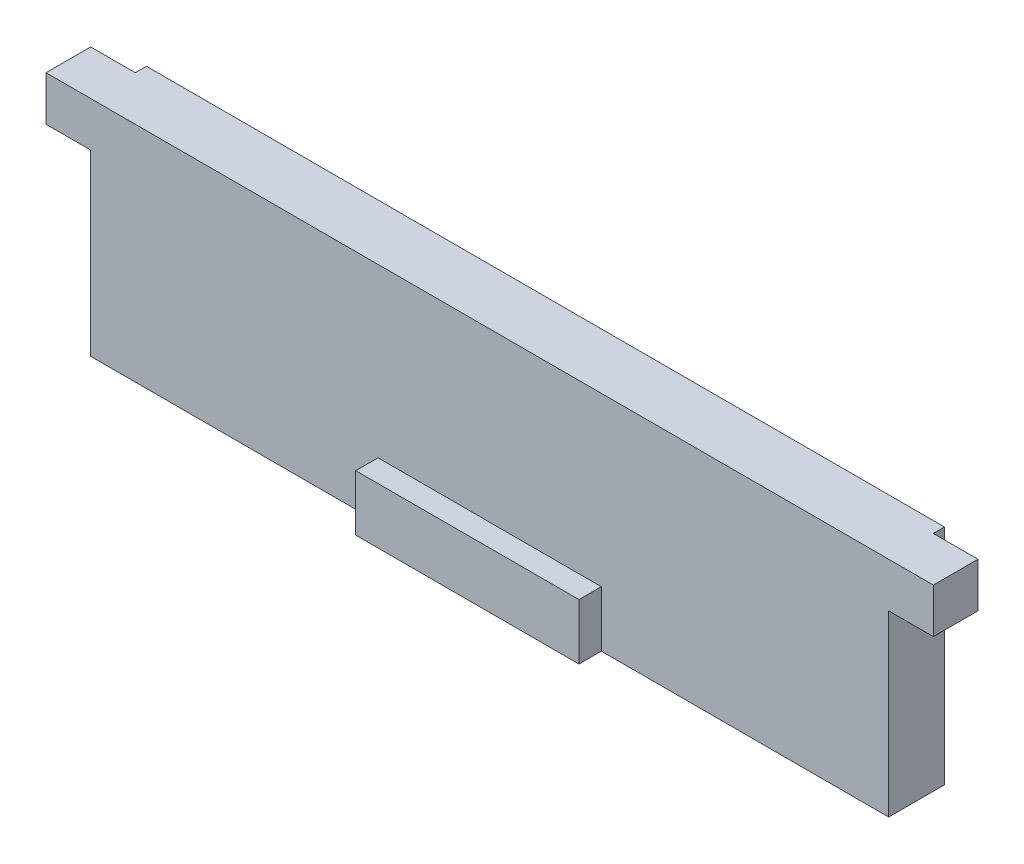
ISO-10303-21;
HEADER;
FILE_DESCRIPTION(('STEP AP214'),'2;1');
FILE_NAME('part.step','',(''),(''),'','','');
FILE_SCHEMA(('AUTOMOTIVE_DESIGN { 1 0 10303 214 1 1 1 1 }'));
ENDSEC;
DATA;
#1=APPLICATION_CONTEXT('core data for automotive mechanical design processes');
#2=APPLICATION_PROTOCOL_DEFINITION('international standard','automotive_design',2000,#1);
#3=PRODUCT_CONTEXT('',#1,'mechanical');
#4=PRODUCT('Part','Part','',(#3));
#5=PRODUCT_RELATED_PRODUCT_CATEGORY('part','',(#4));
#6=PRODUCT_DEFINITION_FORMATION('','',#4);
#7=PRODUCT_DEFINITION_CONTEXT('part definition',#1,'design');
#8=PRODUCT_DEFINITION('design','',#6,#7);
#9=PRODUCT_DEFINITION_SHAPE('','',#8);
#10=(LENGTH_UNIT() NAMED_UNIT(*) SI_UNIT(.MILLI.,.METRE.));
#11=(NAMED_UNIT(*) PLANE_ANGLE_UNIT() SI_UNIT($,.RADIAN.));
#12=(NAMED_UNIT(*) SI_UNIT($,.STERADIAN.) SOLID_ANGLE_UNIT());
#13=UNCERTAINTY_MEASURE_WITH_UNIT(LENGTH_MEASURE(1.E-05),#10,'distance_accuracy_value','');
#14=(GEOMETRIC_REPRESENTATION_CONTEXT(3) GLOBAL_UNCERTAINTY_ASSIGNED_CONTEXT((#13)) GLOBAL_UNIT_ASSIGNED_CONTEXT((#10,
#11,#12)) REPRESENTATION_CONTEXT('',''));
#15=CARTESIAN_POINT('',(0.,0.,0.));
#16=DIRECTION('',(0.,0.,1.));
#17=DIRECTION('',(1.,0.,0.));
#18=AXIS2_PLACEMENT_3D('',#15,#16,#17);
#19=CARTESIAN_POINT('',(71.485224,20.,0.));
#20=DIRECTION('',(-1.,0.,0.));
#21=DIRECTION('',(0.,0.,1.));
#22=AXIS2_PLACEMENT_3D('',#19,#20,#21);
#23=PLANE('',#22);
#24=DIRECTION('',(0.,1.,0.));
#25=VECTOR('',#24,1.);
#26=CARTESIAN_POINT('',(71.485224,16.,-4.));
#27=LINE('',#26,#25);
#28=CARTESIAN_POINT('',(71.485224,16.,-4.));
#29=VERTEX_POINT('',#28);
#30=CARTESIAN_POINT('',(71.485224,20.,-4.));
#31=VERTEX_POINT('',#30);
#32=EDGE_CURVE('E142',#29,#31,#27,.T.);
#33=ORIENTED_EDGE('',*,*,#32,.F.);
#34=DIRECTION('',(0.,0.,1.));
#35=VECTOR('',#34,1.);
#36=CARTESIAN_POINT('',(71.485224,16.,0.));
#37=LINE('',#36,#35);
#38=CARTESIAN_POINT('',(71.485224,16.,0.));
#39=VERTEX_POINT('',#38);
#40=EDGE_CURVE('E160',#29,#39,#37,.T.);
#41=ORIENTED_EDGE('',*,*,#40,.T.);
#42=DIRECTION('',(0.,-1.,0.));
#43=VECTOR('',#42,1.);
#44=CARTESIAN_POINT('',(71.485224,20.,0.));
#45=LINE('',#44,#43);
#46=CARTESIAN_POINT('',(71.485224,0.,0.));
#47=VERTEX_POINT('',#46);
#48=EDGE_CURVE('E48',#39,#47,#45,.T.);
#49=ORIENTED_EDGE('',*,*,#48,.T.);
#50=DIRECTION('',(0.,0.,-1.));
#51=VECTOR('',#50,1.);
#52=CARTESIAN_POINT('',(71.485224,0.,0.));
#53=LINE('',#52,#51);
#54=CARTESIAN_POINT('',(71.485224,0.,-5.));
#55=VERTEX_POINT('',#54);
#56=EDGE_CURVE('E181',#47,#55,#53,.T.);
#57=ORIENTED_EDGE('',*,*,#56,.T.);
#58=DIRECTION('',(0.,-1.,0.));
#59=VECTOR('',#58,1.);
#60=CARTESIAN_POINT('',(71.485224,20.,-5.));
#61=LINE('',#60,#59);
#62=CARTESIAN_POINT('',(71.485224,20.,-5.));
#63=VERTEX_POINT('',#62);
#64=EDGE_CURVE('E163',#63,#55,#61,.T.);
#65=ORIENTED_EDGE('',*,*,#64,.F.);
#66=DIRECTION('',(0.,0.,-1.));
#67=VECTOR('',#66,1.);
#68=CARTESIAN_POINT('',(71.485224,20.,0.));
#69=LINE('',#68,#67);
#70=EDGE_CURVE('E156',#31,#63,#69,.T.);
#71=ORIENTED_EDGE('',*,*,#70,.F.);
#72=EDGE_LOOP('',(#33,#41,#49,#57,#65,#71));
#73=FACE_BOUND('',#72,.T.);
#74=ADVANCED_FACE('F40',(#73),#23,.F.);
#75=CARTESIAN_POINT('',(0.,20.,0.));
#76=DIRECTION('',(1.,0.,0.));
#77=DIRECTION('',(0.,0.,-1.));
#78=AXIS2_PLACEMENT_3D('',#75,#76,#77);
#79=PLANE('',#78);
#80=DIRECTION('',(0.,-1.,0.));
#81=VECTOR('',#80,1.);
#82=CARTESIAN_POINT('',(0.,20.,0.));
#83=LINE('',#82,#81);
#84=CARTESIAN_POINT('',(0.,16.,0.));
#85=VERTEX_POINT('',#84);
#86=CARTESIAN_POINT('',(0.,0.,0.));
#87=VERTEX_POINT('',#86);
#88=EDGE_CURVE('E11',#85,#87,#83,.T.);
#89=ORIENTED_EDGE('',*,*,#88,.F.);
#90=DIRECTION('',(0.,0.,-1.));
#91=VECTOR('',#90,1.);
#92=CARTESIAN_POINT('',(0.,16.,0.));
#93=LINE('',#92,#91);
#94=CARTESIAN_POINT('',(0.,16.,-4.));
#95=VERTEX_POINT('',#94);
#96=EDGE_CURVE('E247',#85,#95,#93,.T.);
#97=ORIENTED_EDGE('',*,*,#96,.T.);
#98=DIRECTION('',(0.,1.,0.));
#99=VECTOR('',#98,1.);
#100=CARTESIAN_POINT('',(0.,16.,-4.));
#101=LINE('',#100,#99);
#102=CARTESIAN_POINT('',(0.,20.,-4.));
#103=VERTEX_POINT('',#102);
#104=EDGE_CURVE('E209',#95,#103,#101,.T.);
#105=ORIENTED_EDGE('',*,*,#104,.T.);
#106=DIRECTION('',(0.,0.,1.));
#107=VECTOR('',#106,1.);
#108=CARTESIAN_POINT('',(0.,20.,0.));
#109=LINE('',#108,#107);
#110=CARTESIAN_POINT('',(0.,20.,-5.));
#111=VERTEX_POINT('',#110);
#112=EDGE_CURVE('E170',#111,#103,#109,.T.);
#113=ORIENTED_EDGE('',*,*,#112,.F.);
#114=DIRECTION('',(0.,-1.,0.));
#115=VECTOR('',#114,1.);
#116=CARTESIAN_POINT('',(0.,20.,-5.));
#117=LINE('',#116,#115);
#118=CARTESIAN_POINT('',(0.,0.,-5.));
#119=VERTEX_POINT('',#118);
#120=EDGE_CURVE('E168',#111,#119,#117,.T.);
#121=ORIENTED_EDGE('',*,*,#120,.T.);
#122=DIRECTION('',(0.,0.,1.));
#123=VECTOR('',#122,1.);
#124=CARTESIAN_POINT('',(0.,0.,0.));
#125=LINE('',#124,#123);
#126=EDGE_CURVE('E174',#119,#87,#125,.T.);
#127=ORIENTED_EDGE('',*,*,#126,.T.);
#128=EDGE_LOOP('',(#89,#97,#105,#113,#121,#127));
#129=FACE_BOUND('',#128,.T.);
#130=ADVANCED_FACE('F42',(#129),#79,.F.);
#131=CARTESIAN_POINT('',(0.,20.,0.));
#132=DIRECTION('',(0.,0.,-1.));
#133=DIRECTION('',(-1.,0.,0.));
#134=AXIS2_PLACEMENT_3D('',#131,#132,#133);
#135=PLANE('',#134);
#136=DIRECTION('',(1.,0.,0.));
#137=VECTOR('',#136,1.);
#138=CARTESIAN_POINT('',(0.,0.,0.));
#139=LINE('',#138,#137);
#140=CARTESIAN_POINT('',(25.742612,0.,0.));
#141=VERTEX_POINT('',#140);
#142=EDGE_CURVE('E179',#87,#141,#139,.T.);
#143=ORIENTED_EDGE('',*,*,#142,.T.);
#144=DIRECTION('',(0.,1.,0.));
#145=VECTOR('',#144,1.);
#146=CARTESIAN_POINT('',(25.742612,0.,0.));
#147=LINE('',#146,#145);
#148=CARTESIAN_POINT('',(25.742612,5.,0.));
#149=VERTEX_POINT('',#148);
#150=EDGE_CURVE('E222',#141,#149,#147,.T.);
#151=ORIENTED_EDGE('',*,*,#150,.T.);
#152=DIRECTION('',(1.,0.,0.));
#153=VECTOR('',#152,1.);
#154=CARTESIAN_POINT('',(0.,5.,0.));
#155=LINE('',#154,#153);
#156=CARTESIAN_POINT('',(45.742612,5.,0.));
#157=VERTEX_POINT('',#156);
#158=EDGE_CURVE('E225',#149,#157,#155,.T.);
#159=ORIENTED_EDGE('',*,*,#158,.T.);
#160=DIRECTION('',(0.,1.,0.));
#161=VECTOR('',#160,1.);
#162=CARTESIAN_POINT('',(45.742612,0.,0.));
#163=LINE('',#162,#161);
#164=CARTESIAN_POINT('',(45.742612,0.,0.));
#165=VERTEX_POINT('',#164);
#166=EDGE_CURVE('E194',#165,#157,#163,.T.);
#167=ORIENTED_EDGE('',*,*,#166,.F.);
#168=EDGE_CURVE('E177',#165,#47,#139,.T.);
#169=ORIENTED_EDGE('',*,*,#168,.T.);
#170=ORIENTED_EDGE('',*,*,#48,.F.);
#171=DIRECTION('',(1.,0.,0.));
#172=VECTOR('',#171,1.);
#173=CARTESIAN_POINT('',(71.485224,16.,0.));
#174=LINE('',#173,#172);
#175=CARTESIAN_POINT('',(75.485224,16.,0.));
#176=VERTEX_POINT('',#175);
#177=EDGE_CURVE('E55',#39,#176,#174,.T.);
#178=ORIENTED_EDGE('',*,*,#177,.T.);
#179=DIRECTION('',(0.,1.,0.));
#180=VECTOR('',#179,1.);
#181=CARTESIAN_POINT('',(75.485224,16.,0.));
#182=LINE('',#181,#180);
#183=CARTESIAN_POINT('',(75.485224,20.,0.));
#184=VERTEX_POINT('',#183);
#185=EDGE_CURVE('E264',#176,#184,#182,.T.);
#186=ORIENTED_EDGE('',*,*,#185,.T.);
#187=DIRECTION('',(1.,0.,0.));
#188=VECTOR('',#187,1.);
#189=CARTESIAN_POINT('',(0.,20.,0.));
#190=LINE('',#189,#188);
#191=CARTESIAN_POINT('',(-4.,20.,0.));
#192=VERTEX_POINT('',#191);
#193=EDGE_CURVE('E166',#192,#184,#190,.T.);
#194=ORIENTED_EDGE('',*,*,#193,.F.);
#195=DIRECTION('',(0.,1.,0.));
#196=VECTOR('',#195,1.);
#197=CARTESIAN_POINT('',(-4.,16.,0.));
#198=LINE('',#197,#196);
#199=CARTESIAN_POINT('',(-4.,16.,0.));
#200=VERTEX_POINT('',#199);
#201=EDGE_CURVE('E228',#200,#192,#198,.T.);
#202=ORIENTED_EDGE('',*,*,#201,.F.);
#203=DIRECTION('',(1.,0.,0.));
#204=VECTOR('',#203,1.);
#205=CARTESIAN_POINT('',(0.,16.,0.));
#206=LINE('',#205,#204);
#207=EDGE_CURVE('E240',#200,#85,#206,.T.);
#208=ORIENTED_EDGE('',*,*,#207,.T.);
#209=ORIENTED_EDGE('',*,*,#88,.T.);
#210=EDGE_LOOP('',(#143,#151,#159,#167,#169,#170,#178,#186,#194,#202,#208,#209));
#211=FACE_BOUND('',#210,.T.);
#212=ADVANCED_FACE('F192',(#211),#135,.F.);
#213=CARTESIAN_POINT('',(0.,20.,-5.));
#214=DIRECTION('',(0.,0.,1.));
#215=DIRECTION('',(1.,0.,0.));
#216=AXIS2_PLACEMENT_3D('',#213,#214,#215);
#217=PLANE('',#216);
#218=DIRECTION('',(-1.,0.,0.));
#219=VECTOR('',#218,1.);
#220=CARTESIAN_POINT('',(0.,0.,-5.));
#221=LINE('',#220,#219);
#222=EDGE_CURVE('E183',#55,#119,#221,.T.);
#223=ORIENTED_EDGE('',*,*,#222,.T.);
#224=ORIENTED_EDGE('',*,*,#120,.F.);
#225=DIRECTION('',(-1.,0.,0.));
#226=VECTOR('',#225,1.);
#227=CARTESIAN_POINT('',(0.,20.,-5.));
#228=LINE('',#227,#226);
#229=EDGE_CURVE('E165',#63,#111,#228,.T.);
#230=ORIENTED_EDGE('',*,*,#229,.F.);
#231=ORIENTED_EDGE('',*,*,#64,.T.);
#232=EDGE_LOOP('',(#223,#224,#230,#231));
#233=FACE_BOUND('',#232,.T.);
#234=ADVANCED_FACE('F204',(#233),#217,.F.);
#235=CARTESIAN_POINT('',(0.,20.,0.));
#236=DIRECTION('',(0.,-1.,0.));
#237=DIRECTION('',(0.,0.,-1.));
#238=AXIS2_PLACEMENT_3D('',#235,#236,#237);
#239=PLANE('',#238);
#240=ORIENTED_EDGE('',*,*,#112,.T.);
#241=DIRECTION('',(-1.,0.,0.));
#242=VECTOR('',#241,1.);
#243=CARTESIAN_POINT('',(0.,20.,-4.));
#244=LINE('',#243,#242);
#245=CARTESIAN_POINT('',(-4.,20.,-4.));
#246=VERTEX_POINT('',#245);
#247=EDGE_CURVE('E63',#103,#246,#244,.T.);
#248=ORIENTED_EDGE('',*,*,#247,.T.);
#249=DIRECTION('',(0.,0.,1.));
#250=VECTOR('',#249,1.);
#251=CARTESIAN_POINT('',(-4.,20.,0.));
#252=LINE('',#251,#250);
#253=EDGE_CURVE('E244',#246,#192,#252,.T.);
#254=ORIENTED_EDGE('',*,*,#253,.T.);
#255=ORIENTED_EDGE('',*,*,#193,.T.);
#256=DIRECTION('',(0.,0.,-1.));
#257=VECTOR('',#256,1.);
#258=CARTESIAN_POINT('',(75.485224,20.,0.));
#259=LINE('',#258,#257);
#260=CARTESIAN_POINT('',(75.485224,20.,-4.));
#261=VERTEX_POINT('',#260);
#262=EDGE_CURVE('E159',#184,#261,#259,.T.);
#263=ORIENTED_EDGE('',*,*,#262,.T.);
#264=DIRECTION('',(-1.,0.,0.));
#265=VECTOR('',#264,1.);
#266=CARTESIAN_POINT('',(71.485224,20.,-4.));
#267=LINE('',#266,#265);
#268=EDGE_CURVE('E145',#261,#31,#267,.T.);
#269=ORIENTED_EDGE('',*,*,#268,.T.);
#270=ORIENTED_EDGE('',*,*,#70,.T.);
#271=ORIENTED_EDGE('',*,*,#229,.T.);
#272=EDGE_LOOP('',(#240,#248,#254,#255,#263,#269,#270,#271));
#273=FACE_BOUND('',#272,.T.);
#274=ADVANCED_FACE('F155',(#273),#239,.F.);
#275=CARTESIAN_POINT('',(0.,0.,0.));
#276=DIRECTION('',(0.,-1.,0.));
#277=DIRECTION('',(0.,0.,-1.));
#278=AXIS2_PLACEMENT_3D('',#275,#276,#277);
#279=PLANE('',#278);
#280=ORIENTED_EDGE('',*,*,#126,.F.);
#281=ORIENTED_EDGE('',*,*,#222,.F.);
#282=ORIENTED_EDGE('',*,*,#56,.F.);
#283=ORIENTED_EDGE('',*,*,#168,.F.);
#284=DIRECTION('',(0.,0.,-1.));
#285=VECTOR('',#284,1.);
#286=CARTESIAN_POINT('',(45.742612,0.,2.));
#287=LINE('',#286,#285);
#288=CARTESIAN_POINT('',(45.742612,0.,2.));
#289=VERTEX_POINT('',#288);
#290=EDGE_CURVE('E178',#289,#165,#287,.T.);
#291=ORIENTED_EDGE('',*,*,#290,.F.);
#292=DIRECTION('',(1.,0.,0.));
#293=VECTOR('',#292,1.);
#294=CARTESIAN_POINT('',(0.,0.,2.));
#295=LINE('',#294,#293);
#296=CARTESIAN_POINT('',(25.742612,0.,2.));
#297=VERTEX_POINT('',#296);
#298=EDGE_CURVE('E224',#297,#289,#295,.T.);
#299=ORIENTED_EDGE('',*,*,#298,.F.);
#300=DIRECTION('',(0.,0.,-1.));
#301=VECTOR('',#300,1.);
#302=CARTESIAN_POINT('',(25.742612,0.,2.));
#303=LINE('',#302,#301);
#304=EDGE_CURVE('E218',#297,#141,#303,.T.);
#305=ORIENTED_EDGE('',*,*,#304,.T.);
#306=ORIENTED_EDGE('',*,*,#142,.F.);
#307=EDGE_LOOP('',(#280,#281,#282,#283,#291,#299,#305,#306));
#308=FACE_BOUND('',#307,.T.);
#309=ADVANCED_FACE('F200',(#308),#279,.T.);
#310=CARTESIAN_POINT('',(45.742612,0.,2.));
#311=DIRECTION('',(-1.,0.,0.));
#312=DIRECTION('',(0.,0.,1.));
#313=AXIS2_PLACEMENT_3D('',#310,#311,#312);
#314=PLANE('',#313);
#315=ORIENTED_EDGE('',*,*,#166,.T.);
#316=DIRECTION('',(0.,0.,-1.));
#317=VECTOR('',#316,1.);
#318=CARTESIAN_POINT('',(45.742612,5.,2.));
#319=LINE('',#318,#317);
#320=CARTESIAN_POINT('',(45.742612,5.,2.));
#321=VERTEX_POINT('',#320);
#322=EDGE_CURVE('E212',#321,#157,#319,.T.);
#323=ORIENTED_EDGE('',*,*,#322,.F.);
#324=DIRECTION('',(0.,1.,0.));
#325=VECTOR('',#324,1.);
#326=CARTESIAN_POINT('',(45.742612,0.,2.));
#327=LINE('',#326,#325);
#328=EDGE_CURVE('E234',#289,#321,#327,.T.);
#329=ORIENTED_EDGE('',*,*,#328,.F.);
#330=ORIENTED_EDGE('',*,*,#290,.T.);
#331=EDGE_LOOP('',(#315,#323,#329,#330));
#332=FACE_BOUND('',#331,.T.);
#333=ADVANCED_FACE('F297',(#332),#314,.F.);
#334=CARTESIAN_POINT('',(0.,5.,2.));
#335=DIRECTION('',(0.,1.,0.));
#336=DIRECTION('',(0.,0.,1.));
#337=AXIS2_PLACEMENT_3D('',#334,#335,#336);
#338=PLANE('',#337);
#339=ORIENTED_EDGE('',*,*,#158,.F.);
#340=DIRECTION('',(0.,0.,-1.));
#341=VECTOR('',#340,1.);
#342=CARTESIAN_POINT('',(25.742612,5.,2.));
#343=LINE('',#342,#341);
#344=CARTESIAN_POINT('',(25.742612,5.,2.));
#345=VERTEX_POINT('',#344);
#346=EDGE_CURVE('E215',#345,#149,#343,.T.);
#347=ORIENTED_EDGE('',*,*,#346,.F.);
#348=DIRECTION('',(1.,0.,0.));
#349=VECTOR('',#348,1.);
#350=CARTESIAN_POINT('',(0.,5.,2.));
#351=LINE('',#350,#349);
#352=EDGE_CURVE('E231',#345,#321,#351,.T.);
#353=ORIENTED_EDGE('',*,*,#352,.T.);
#354=ORIENTED_EDGE('',*,*,#322,.T.);
#355=EDGE_LOOP('',(#339,#347,#353,#354));
#356=FACE_BOUND('',#355,.T.);
#357=ADVANCED_FACE('F301',(#356),#338,.T.);
#358=CARTESIAN_POINT('',(25.742612,0.,2.));
#359=DIRECTION('',(-1.,0.,0.));
#360=DIRECTION('',(0.,0.,1.));
#361=AXIS2_PLACEMENT_3D('',#358,#359,#360);
#362=PLANE('',#361);
#363=ORIENTED_EDGE('',*,*,#150,.F.);
#364=ORIENTED_EDGE('',*,*,#304,.F.);
#365=DIRECTION('',(0.,1.,0.));
#366=VECTOR('',#365,1.);
#367=CARTESIAN_POINT('',(25.742612,0.,2.));
#368=LINE('',#367,#366);
#369=EDGE_CURVE('E221',#297,#345,#368,.T.);
#370=ORIENTED_EDGE('',*,*,#369,.T.);
#371=ORIENTED_EDGE('',*,*,#346,.T.);
#372=EDGE_LOOP('',(#363,#364,#370,#371));
#373=FACE_BOUND('',#372,.T.);
#374=ADVANCED_FACE('F305',(#373),#362,.T.);
#375=CARTESIAN_POINT('',(0.,0.,2.));
#376=DIRECTION('',(0.,0.,1.));
#377=DIRECTION('',(1.,0.,0.));
#378=AXIS2_PLACEMENT_3D('',#375,#376,#377);
#379=PLANE('',#378);
#380=ORIENTED_EDGE('',*,*,#298,.T.);
#381=ORIENTED_EDGE('',*,*,#328,.T.);
#382=ORIENTED_EDGE('',*,*,#352,.F.);
#383=ORIENTED_EDGE('',*,*,#369,.F.);
#384=EDGE_LOOP('',(#380,#381,#382,#383));
#385=FACE_BOUND('',#384,.T.);
#386=ADVANCED_FACE('F309',(#385),#379,.T.);
#387=CARTESIAN_POINT('',(-4.,16.,0.));
#388=DIRECTION('',(-1.,0.,0.));
#389=DIRECTION('',(0.,0.,1.));
#390=AXIS2_PLACEMENT_3D('',#387,#388,#389);
#391=PLANE('',#390);
#392=ORIENTED_EDGE('',*,*,#253,.F.);
#393=DIRECTION('',(0.,1.,0.));
#394=VECTOR('',#393,1.);
#395=CARTESIAN_POINT('',(-4.,16.,-4.));
#396=LINE('',#395,#394);
#397=CARTESIAN_POINT('',(-4.,16.,-4.));
#398=VERTEX_POINT('',#397);
#399=EDGE_CURVE('E239',#398,#246,#396,.T.);
#400=ORIENTED_EDGE('',*,*,#399,.F.);
#401=DIRECTION('',(0.,0.,1.));
#402=VECTOR('',#401,1.);
#403=CARTESIAN_POINT('',(-4.,16.,0.));
#404=LINE('',#403,#402);
#405=EDGE_CURVE('E251',#398,#200,#404,.T.);
#406=ORIENTED_EDGE('',*,*,#405,.T.);
#407=ORIENTED_EDGE('',*,*,#201,.T.);
#408=EDGE_LOOP('',(#392,#400,#406,#407));
#409=FACE_BOUND('',#408,.T.);
#410=ADVANCED_FACE('F313',(#409),#391,.T.);
#411=CARTESIAN_POINT('',(0.,16.,-4.));
#412=DIRECTION('',(0.,0.,-1.));
#413=DIRECTION('',(-1.,0.,0.));
#414=AXIS2_PLACEMENT_3D('',#411,#412,#413);
#415=PLANE('',#414);
#416=ORIENTED_EDGE('',*,*,#247,.F.);
#417=ORIENTED_EDGE('',*,*,#104,.F.);
#418=DIRECTION('',(-1.,0.,0.));
#419=VECTOR('',#418,1.);
#420=CARTESIAN_POINT('',(0.,16.,-4.));
#421=LINE('',#420,#419);
#422=EDGE_CURVE('E254',#95,#398,#421,.T.);
#423=ORIENTED_EDGE('',*,*,#422,.T.);
#424=ORIENTED_EDGE('',*,*,#399,.T.);
#425=EDGE_LOOP('',(#416,#417,#423,#424));
#426=FACE_BOUND('',#425,.T.);
#427=ADVANCED_FACE('F315',(#426),#415,.T.);
#428=CARTESIAN_POINT('',(0.,16.,0.));
#429=DIRECTION('',(0.,1.,0.));
#430=DIRECTION('',(0.,0.,1.));
#431=AXIS2_PLACEMENT_3D('',#428,#429,#430);
#432=PLANE('',#431);
#433=ORIENTED_EDGE('',*,*,#96,.F.);
#434=ORIENTED_EDGE('',*,*,#207,.F.);
#435=ORIENTED_EDGE('',*,*,#405,.F.);
#436=ORIENTED_EDGE('',*,*,#422,.F.);
#437=EDGE_LOOP('',(#433,#434,#435,#436));
#438=FACE_BOUND('',#437,.T.);
#439=ADVANCED_FACE('F318',(#438),#432,.F.);
#440=CARTESIAN_POINT('',(71.485224,16.,-4.));
#441=DIRECTION('',(0.,0.,-1.));
#442=DIRECTION('',(-1.,0.,0.));
#443=AXIS2_PLACEMENT_3D('',#440,#441,#442);
#444=PLANE('',#443);
#445=ORIENTED_EDGE('',*,*,#268,.F.);
#446=DIRECTION('',(0.,1.,0.));
#447=VECTOR('',#446,1.);
#448=CARTESIAN_POINT('',(75.485224,16.,-4.));
#449=LINE('',#448,#447);
#450=CARTESIAN_POINT('',(75.485224,16.,-4.));
#451=VERTEX_POINT('',#450);
#452=EDGE_CURVE('E150',#451,#261,#449,.T.);
#453=ORIENTED_EDGE('',*,*,#452,.F.);
#454=DIRECTION('',(-1.,0.,0.));
#455=VECTOR('',#454,1.);
#456=CARTESIAN_POINT('',(71.485224,16.,-4.));
#457=LINE('',#456,#455);
#458=EDGE_CURVE('E147',#451,#29,#457,.T.);
#459=ORIENTED_EDGE('',*,*,#458,.T.);
#460=ORIENTED_EDGE('',*,*,#32,.T.);
#461=EDGE_LOOP('',(#445,#453,#459,#460));
#462=FACE_BOUND('',#461,.T.);
#463=ADVANCED_FACE('F144',(#462),#444,.T.);
#464=CARTESIAN_POINT('',(75.485224,16.,0.));
#465=DIRECTION('',(1.,0.,0.));
#466=DIRECTION('',(0.,0.,-1.));
#467=AXIS2_PLACEMENT_3D('',#464,#465,#466);
#468=PLANE('',#467);
#469=ORIENTED_EDGE('',*,*,#262,.F.);
#470=ORIENTED_EDGE('',*,*,#185,.F.);
#471=DIRECTION('',(0.,0.,-1.));
#472=VECTOR('',#471,1.);
#473=CARTESIAN_POINT('',(75.485224,16.,0.));
#474=LINE('',#473,#472);
#475=EDGE_CURVE('E260',#176,#451,#474,.T.);
#476=ORIENTED_EDGE('',*,*,#475,.T.);
#477=ORIENTED_EDGE('',*,*,#452,.T.);
#478=EDGE_LOOP('',(#469,#470,#476,#477));
#479=FACE_BOUND('',#478,.T.);
#480=ADVANCED_FACE('F269',(#479),#468,.T.);
#481=CARTESIAN_POINT('',(0.,16.,0.));
#482=DIRECTION('',(0.,-1.,0.));
#483=DIRECTION('',(0.,0.,-1.));
#484=AXIS2_PLACEMENT_3D('',#481,#482,#483);
#485=PLANE('',#484);
#486=ORIENTED_EDGE('',*,*,#40,.F.);
#487=ORIENTED_EDGE('',*,*,#458,.F.);
#488=ORIENTED_EDGE('',*,*,#475,.F.);
#489=ORIENTED_EDGE('',*,*,#177,.F.);
#490=EDGE_LOOP('',(#486,#487,#488,#489));
#491=FACE_BOUND('',#490,.T.);
#492=ADVANCED_FACE('F270',(#491),#485,.T.);
#493=CLOSED_SHELL('',(#74,#130,#212,#234,#274,#309,#333,#357,#374,#386,#410,#427,#439,#463,#480,#492));
#494=MANIFOLD_SOLID_BREP('B2',#493);
#495=ADVANCED_BREP_SHAPE_REPRESENTATION('',(#18,#494),#14);
#496=SHAPE_DEFINITION_REPRESENTATION(#9,#495);
ENDSEC;
END-ISO-10303-21;
